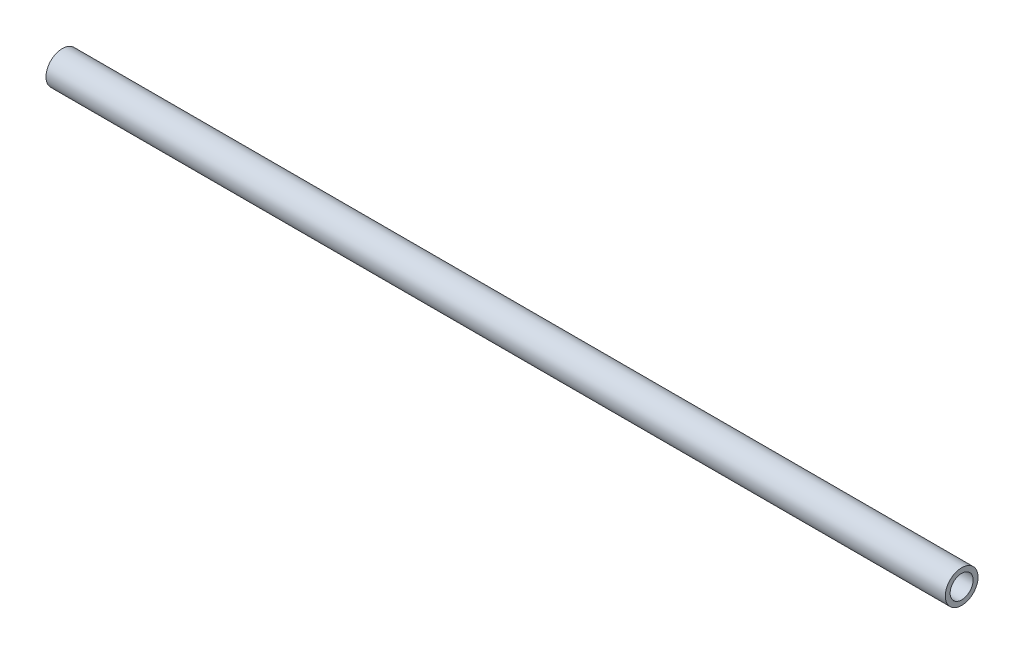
ISO-10303-21;
HEADER;
FILE_DESCRIPTION(('STEP AP214'),'2;1');
FILE_NAME('part.step','',(''),(''),'','','');
FILE_SCHEMA(('AUTOMOTIVE_DESIGN { 1 0 10303 214 1 1 1 1 }'));
ENDSEC;
DATA;
#1=APPLICATION_CONTEXT('core data for automotive mechanical design processes');
#2=APPLICATION_PROTOCOL_DEFINITION('international standard','automotive_design',2000,#1);
#3=PRODUCT_CONTEXT('',#1,'mechanical');
#4=PRODUCT('Part','Part','',(#3));
#5=PRODUCT_RELATED_PRODUCT_CATEGORY('part','',(#4));
#6=PRODUCT_DEFINITION_FORMATION('','',#4);
#7=PRODUCT_DEFINITION_CONTEXT('part definition',#1,'design');
#8=PRODUCT_DEFINITION('design','',#6,#7);
#9=PRODUCT_DEFINITION_SHAPE('','',#8);
#10=(LENGTH_UNIT() NAMED_UNIT(*) SI_UNIT(.MILLI.,.METRE.));
#11=(NAMED_UNIT(*) PLANE_ANGLE_UNIT() SI_UNIT($,.RADIAN.));
#12=(NAMED_UNIT(*) SI_UNIT($,.STERADIAN.) SOLID_ANGLE_UNIT());
#13=UNCERTAINTY_MEASURE_WITH_UNIT(LENGTH_MEASURE(1.E-05),#10,'distance_accuracy_value','');
#14=(GEOMETRIC_REPRESENTATION_CONTEXT(3) GLOBAL_UNCERTAINTY_ASSIGNED_CONTEXT((#13)) GLOBAL_UNIT_ASSIGNED_CONTEXT((#10,
#11,#12)) REPRESENTATION_CONTEXT('',''));
#15=CARTESIAN_POINT('',(0.,0.,0.));
#16=DIRECTION('',(0.,0.,1.));
#17=DIRECTION('',(1.,0.,0.));
#18=AXIS2_PLACEMENT_3D('',#15,#16,#17);
#19=CARTESIAN_POINT('',(304.8,0.,0.));
#20=DIRECTION('',(1.,0.,0.));
#21=DIRECTION('',(0.,0.,-1.));
#22=AXIS2_PLACEMENT_3D('',#19,#20,#21);
#23=PLANE('',#22);
#24=CARTESIAN_POINT('',(304.8,0.,0.));
#25=DIRECTION('',(1.,0.,0.));
#26=DIRECTION('',(0.,0.,-1.));
#27=AXIS2_PLACEMENT_3D('',#24,#25,#26);
#28=CIRCLE('',#27,5.5499);
#29=CARTESIAN_POINT('',(304.8,0.,5.5499));
#30=VERTEX_POINT('',#29);
#31=EDGE_CURVE('E10',#30,#30,#28,.T.);
#32=ORIENTED_EDGE('',*,*,#31,.T.);
#33=EDGE_LOOP('',(#32));
#34=FACE_BOUND('',#33,.T.);
#35=CARTESIAN_POINT('',(304.8,0.,0.));
#36=DIRECTION('',(1.,0.,0.));
#37=DIRECTION('',(0.,0.,-1.));
#38=AXIS2_PLACEMENT_3D('',#35,#36,#37);
#39=CIRCLE('',#38,3.8989);
#40=CARTESIAN_POINT('',(304.8,0.,3.8989));
#41=VERTEX_POINT('',#40);
#42=EDGE_CURVE('E41',#41,#41,#39,.T.);
#43=ORIENTED_EDGE('',*,*,#42,.F.);
#44=EDGE_LOOP('',(#43));
#45=FACE_BOUND('',#44,.T.);
#46=ADVANCED_FACE('F30',(#34,#45),#23,.T.);
#47=CARTESIAN_POINT('',(0.,0.,0.));
#48=DIRECTION('',(1.,0.,0.));
#49=DIRECTION('',(0.,0.,-1.));
#50=AXIS2_PLACEMENT_3D('',#47,#48,#49);
#51=PLANE('',#50);
#52=CARTESIAN_POINT('',(0.,0.,0.));
#53=DIRECTION('',(1.,0.,0.));
#54=DIRECTION('',(0.,0.,-1.));
#55=AXIS2_PLACEMENT_3D('',#52,#53,#54);
#56=CIRCLE('',#55,5.5499);
#57=CARTESIAN_POINT('',(0.,0.,5.5499));
#58=VERTEX_POINT('',#57);
#59=EDGE_CURVE('E34',#58,#58,#56,.T.);
#60=ORIENTED_EDGE('',*,*,#59,.F.);
#61=EDGE_LOOP('',(#60));
#62=FACE_BOUND('',#61,.T.);
#63=CARTESIAN_POINT('',(0.,0.,0.));
#64=DIRECTION('',(1.,0.,0.));
#65=DIRECTION('',(0.,0.,-1.));
#66=AXIS2_PLACEMENT_3D('',#63,#64,#65);
#67=CIRCLE('',#66,3.8989);
#68=CARTESIAN_POINT('',(0.,0.,3.8989));
#69=VERTEX_POINT('',#68);
#70=EDGE_CURVE('E43',#69,#69,#67,.T.);
#71=ORIENTED_EDGE('',*,*,#70,.T.);
#72=EDGE_LOOP('',(#71));
#73=FACE_BOUND('',#72,.T.);
#74=ADVANCED_FACE('F53',(#62,#73),#51,.F.);
#75=CARTESIAN_POINT('',(304.8,0.,0.));
#76=DIRECTION('',(-1.,0.,0.));
#77=DIRECTION('',(0.,0.,1.));
#78=AXIS2_PLACEMENT_3D('',#75,#76,#77);
#79=CYLINDRICAL_SURFACE('',#78,5.5499);
#80=CARTESIAN_POINT('',(304.8,0.,5.5499));
#81=CARTESIAN_POINT('',(301.625,0.,5.5499));
#82=CARTESIAN_POINT('',(298.45,0.,5.5499));
#83=CARTESIAN_POINT('',(292.1,0.,5.5499));
#84=CARTESIAN_POINT('',(288.925,0.,5.5499));
#85=CARTESIAN_POINT('',(282.575,0.,5.5499));
#86=CARTESIAN_POINT('',(279.4,0.,5.5499));
#87=CARTESIAN_POINT('',(273.05,0.,5.5499));
#88=CARTESIAN_POINT('',(269.875,0.,5.5499));
#89=CARTESIAN_POINT('',(263.525,0.,5.5499));
#90=CARTESIAN_POINT('',(260.35,0.,5.5499));
#91=CARTESIAN_POINT('',(254.,0.,5.5499));
#92=CARTESIAN_POINT('',(250.825,0.,5.5499));
#93=CARTESIAN_POINT('',(244.475,0.,5.5499));
#94=CARTESIAN_POINT('',(241.3,0.,5.5499));
#95=CARTESIAN_POINT('',(234.95,0.,5.5499));
#96=CARTESIAN_POINT('',(231.775,0.,5.5499));
#97=CARTESIAN_POINT('',(225.425,0.,5.5499));
#98=CARTESIAN_POINT('',(222.25,0.,5.5499));
#99=CARTESIAN_POINT('',(215.9,0.,5.5499));
#100=CARTESIAN_POINT('',(212.725,0.,5.5499));
#101=CARTESIAN_POINT('',(206.375,0.,5.5499));
#102=CARTESIAN_POINT('',(203.2,0.,5.5499));
#103=CARTESIAN_POINT('',(196.85,0.,5.5499));
#104=CARTESIAN_POINT('',(193.675,0.,5.5499));
#105=CARTESIAN_POINT('',(187.325,0.,5.5499));
#106=CARTESIAN_POINT('',(184.15,0.,5.5499));
#107=CARTESIAN_POINT('',(177.8,0.,5.5499));
#108=CARTESIAN_POINT('',(174.625,0.,5.5499));
#109=CARTESIAN_POINT('',(168.275,0.,5.5499));
#110=CARTESIAN_POINT('',(165.1,0.,5.5499));
#111=CARTESIAN_POINT('',(158.75,0.,5.5499));
#112=CARTESIAN_POINT('',(155.575,0.,5.5499));
#113=CARTESIAN_POINT('',(149.225,0.,5.5499));
#114=CARTESIAN_POINT('',(146.05,0.,5.5499));
#115=CARTESIAN_POINT('',(139.7,0.,5.5499));
#116=CARTESIAN_POINT('',(136.525,0.,5.5499));
#117=CARTESIAN_POINT('',(130.175,0.,5.5499));
#118=CARTESIAN_POINT('',(127.,0.,5.5499));
#119=CARTESIAN_POINT('',(120.65,0.,5.5499));
#120=CARTESIAN_POINT('',(117.475,0.,5.5499));
#121=CARTESIAN_POINT('',(111.125,0.,5.5499));
#122=CARTESIAN_POINT('',(107.95,0.,5.5499));
#123=CARTESIAN_POINT('',(101.6,0.,5.5499));
#124=CARTESIAN_POINT('',(98.425,0.,5.5499));
#125=CARTESIAN_POINT('',(92.075,0.,5.5499));
#126=CARTESIAN_POINT('',(88.9,0.,5.5499));
#127=CARTESIAN_POINT('',(82.55,0.,5.5499));
#128=CARTESIAN_POINT('',(79.375,0.,5.5499));
#129=CARTESIAN_POINT('',(73.025,0.,5.5499));
#130=CARTESIAN_POINT('',(69.85,0.,5.5499));
#131=CARTESIAN_POINT('',(63.5,0.,5.5499));
#132=CARTESIAN_POINT('',(60.325,0.,5.5499));
#133=CARTESIAN_POINT('',(53.975,0.,5.5499));
#134=CARTESIAN_POINT('',(50.8,0.,5.5499));
#135=CARTESIAN_POINT('',(44.45,0.,5.5499));
#136=CARTESIAN_POINT('',(41.275,0.,5.5499));
#137=CARTESIAN_POINT('',(34.925,0.,5.5499));
#138=CARTESIAN_POINT('',(31.75,0.,5.5499));
#139=CARTESIAN_POINT('',(25.4,0.,5.5499));
#140=CARTESIAN_POINT('',(22.225,0.,5.5499));
#141=CARTESIAN_POINT('',(15.875,0.,5.5499));
#142=CARTESIAN_POINT('',(12.7,0.,5.5499));
#143=CARTESIAN_POINT('',(6.35,0.,5.5499));
#144=CARTESIAN_POINT('',(3.175,0.,5.5499));
#145=CARTESIAN_POINT('',(0.,0.,5.5499));
#146=B_SPLINE_CURVE_WITH_KNOTS('',3,(#80,#81,#82,#83,#84,#85,#86,#87,#88,#89,#90,#91,#92,#93,
#94,#95,#96,#97,#98,#99,#100,#101,#102,#103,#104,#105,#106,#107,#108,#109,#110,#111,#112,#113,
#114,#115,#116,#117,#118,#119,#120,#121,#122,#123,#124,#125,#126,#127,#128,#129,#130,#131,#132,
#133,#134,#135,#136,#137,#138,#139,#140,#141,#142,#143,#144,#145),.UNSPECIFIED.,.F.,.F.,(4,2,2,
2,2,2,2,2,2,2,2,2,2,2,2,2,2,2,2,2,2,2,2,2,2,2,2,2,2,2,2,2,4),(0.,9.52500000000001,19.05,28.575,
38.1,47.625,57.15,66.675,76.2,85.7250000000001,95.2500000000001,104.775,114.3,123.825,133.35,
142.875,152.4,161.925,171.45,180.975,190.5,200.025,209.55,219.075,228.6,238.125,247.65,257.175,
266.7,276.225,285.75,295.275,304.8),.UNSPECIFIED.);
#147=EDGE_CURVE('BSEAM32',#30,#58,#146,.T.);
#148=ORIENTED_EDGE('',*,*,#31,.F.);
#149=ORIENTED_EDGE('',*,*,#59,.T.);
#150=ORIENTED_EDGE('',*,*,#147,.T.);
#151=ORIENTED_EDGE('',*,*,#147,.F.);
#152=EDGE_LOOP('',(#148,#150,#149,#151));
#153=FACE_BOUND('',#152,.T.);
#154=ADVANCED_FACE('F32',(#153),#79,.T.);
#155=CARTESIAN_POINT('',(304.8,0.,0.));
#156=DIRECTION('',(-1.,0.,0.));
#157=DIRECTION('',(0.,0.,1.));
#158=AXIS2_PLACEMENT_3D('',#155,#156,#157);
#159=CYLINDRICAL_SURFACE('',#158,3.8989);
#160=CARTESIAN_POINT('',(304.8,0.,3.8989));
#161=CARTESIAN_POINT('',(301.625,0.,3.8989));
#162=CARTESIAN_POINT('',(298.45,0.,3.8989));
#163=CARTESIAN_POINT('',(292.1,0.,3.8989));
#164=CARTESIAN_POINT('',(288.925,0.,3.8989));
#165=CARTESIAN_POINT('',(282.575,0.,3.8989));
#166=CARTESIAN_POINT('',(279.4,0.,3.8989));
#167=CARTESIAN_POINT('',(273.05,0.,3.8989));
#168=CARTESIAN_POINT('',(269.875,0.,3.8989));
#169=CARTESIAN_POINT('',(263.525,0.,3.8989));
#170=CARTESIAN_POINT('',(260.35,0.,3.8989));
#171=CARTESIAN_POINT('',(254.,0.,3.8989));
#172=CARTESIAN_POINT('',(250.825,0.,3.8989));
#173=CARTESIAN_POINT('',(244.475,0.,3.8989));
#174=CARTESIAN_POINT('',(241.3,0.,3.8989));
#175=CARTESIAN_POINT('',(234.95,0.,3.8989));
#176=CARTESIAN_POINT('',(231.775,0.,3.8989));
#177=CARTESIAN_POINT('',(225.425,0.,3.8989));
#178=CARTESIAN_POINT('',(222.25,0.,3.8989));
#179=CARTESIAN_POINT('',(215.9,0.,3.8989));
#180=CARTESIAN_POINT('',(212.725,0.,3.8989));
#181=CARTESIAN_POINT('',(206.375,0.,3.8989));
#182=CARTESIAN_POINT('',(203.2,0.,3.8989));
#183=CARTESIAN_POINT('',(196.85,0.,3.8989));
#184=CARTESIAN_POINT('',(193.675,0.,3.8989));
#185=CARTESIAN_POINT('',(187.325,0.,3.8989));
#186=CARTESIAN_POINT('',(184.15,0.,3.8989));
#187=CARTESIAN_POINT('',(177.8,0.,3.8989));
#188=CARTESIAN_POINT('',(174.625,0.,3.8989));
#189=CARTESIAN_POINT('',(168.275,0.,3.8989));
#190=CARTESIAN_POINT('',(165.1,0.,3.8989));
#191=CARTESIAN_POINT('',(158.75,0.,3.8989));
#192=CARTESIAN_POINT('',(155.575,0.,3.8989));
#193=CARTESIAN_POINT('',(149.225,0.,3.8989));
#194=CARTESIAN_POINT('',(146.05,0.,3.8989));
#195=CARTESIAN_POINT('',(139.7,0.,3.8989));
#196=CARTESIAN_POINT('',(136.525,0.,3.8989));
#197=CARTESIAN_POINT('',(130.175,0.,3.8989));
#198=CARTESIAN_POINT('',(127.,0.,3.8989));
#199=CARTESIAN_POINT('',(120.65,0.,3.8989));
#200=CARTESIAN_POINT('',(117.475,0.,3.8989));
#201=CARTESIAN_POINT('',(111.125,0.,3.8989));
#202=CARTESIAN_POINT('',(107.95,0.,3.8989));
#203=CARTESIAN_POINT('',(101.6,0.,3.8989));
#204=CARTESIAN_POINT('',(98.425,0.,3.8989));
#205=CARTESIAN_POINT('',(92.075,0.,3.8989));
#206=CARTESIAN_POINT('',(88.9,0.,3.8989));
#207=CARTESIAN_POINT('',(82.55,0.,3.8989));
#208=CARTESIAN_POINT('',(79.375,0.,3.8989));
#209=CARTESIAN_POINT('',(73.025,0.,3.8989));
#210=CARTESIAN_POINT('',(69.85,0.,3.8989));
#211=CARTESIAN_POINT('',(63.5,0.,3.8989));
#212=CARTESIAN_POINT('',(60.325,0.,3.8989));
#213=CARTESIAN_POINT('',(53.975,0.,3.8989));
#214=CARTESIAN_POINT('',(50.8,0.,3.8989));
#215=CARTESIAN_POINT('',(44.45,0.,3.8989));
#216=CARTESIAN_POINT('',(41.275,0.,3.8989));
#217=CARTESIAN_POINT('',(34.925,0.,3.8989));
#218=CARTESIAN_POINT('',(31.75,0.,3.8989));
#219=CARTESIAN_POINT('',(25.4,0.,3.8989));
#220=CARTESIAN_POINT('',(22.225,0.,3.8989));
#221=CARTESIAN_POINT('',(15.875,0.,3.8989));
#222=CARTESIAN_POINT('',(12.7,0.,3.8989));
#223=CARTESIAN_POINT('',(6.35,0.,3.8989));
#224=CARTESIAN_POINT('',(3.175,0.,3.8989));
#225=CARTESIAN_POINT('',(0.,0.,3.8989));
#226=B_SPLINE_CURVE_WITH_KNOTS('',3,(#160,#161,#162,#163,#164,#165,#166,#167,#168,#169,#170,
#171,#172,#173,#174,#175,#176,#177,#178,#179,#180,#181,#182,#183,#184,#185,#186,#187,#188,#189,
#190,#191,#192,#193,#194,#195,#196,#197,#198,#199,#200,#201,#202,#203,#204,#205,#206,#207,#208,
#209,#210,#211,#212,#213,#214,#215,#216,#217,#218,#219,#220,#221,#222,#223,#224,#225),
.UNSPECIFIED.,.F.,.F.,(4,2,2,2,2,2,2,2,2,2,2,2,2,2,2,2,2,2,2,2,2,2,2,2,2,2,2,2,2,2,2,2,4),(0.,
9.52499999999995,19.05,28.575,38.1,47.625,57.15,66.675,76.2,85.725,95.2499999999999,104.775,
114.3,123.825,133.35,142.875,152.4,161.925,171.45,180.975,190.5,200.025,209.55,219.075,228.6,
238.125,247.65,257.175,266.7,276.225,285.75,295.275,304.8),.UNSPECIFIED.);
#227=EDGE_CURVE('BSEAM49',#41,#69,#226,.T.);
#228=ORIENTED_EDGE('',*,*,#42,.T.);
#229=ORIENTED_EDGE('',*,*,#70,.F.);
#230=ORIENTED_EDGE('',*,*,#227,.T.);
#231=ORIENTED_EDGE('',*,*,#227,.F.);
#232=EDGE_LOOP('',(#228,#230,#229,#231));
#233=FACE_BOUND('',#232,.T.);
#234=ADVANCED_FACE('F49',(#233),#159,.F.);
#235=CLOSED_SHELL('',(#46,#74,#154,#234));
#236=MANIFOLD_SOLID_BREP('B2',#235);
#237=ADVANCED_BREP_SHAPE_REPRESENTATION('',(#18,#236),#14);
#238=SHAPE_DEFINITION_REPRESENTATION(#9,#237);
ENDSEC;
END-ISO-10303-21;
